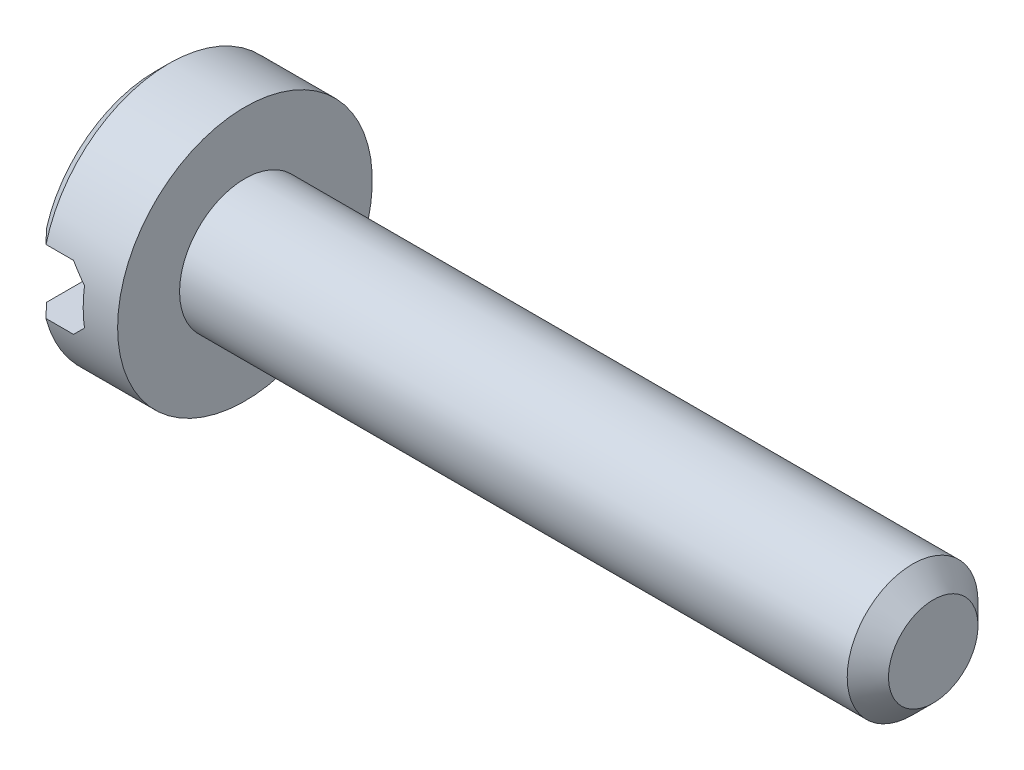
ISO-10303-21;
HEADER;
FILE_DESCRIPTION(('STEP AP214'),'2;1');
FILE_NAME('part.step','',(''),(''),'','','');
FILE_SCHEMA(('AUTOMOTIVE_DESIGN { 1 0 10303 214 1 1 1 1 }'));
ENDSEC;
DATA;
#1=APPLICATION_CONTEXT('core data for automotive mechanical design processes');
#2=APPLICATION_PROTOCOL_DEFINITION('international standard','automotive_design',2000,#1);
#3=PRODUCT_CONTEXT('',#1,'mechanical');
#4=PRODUCT('Part','Part','',(#3));
#5=PRODUCT_RELATED_PRODUCT_CATEGORY('part','',(#4));
#6=PRODUCT_DEFINITION_FORMATION('','',#4);
#7=PRODUCT_DEFINITION_CONTEXT('part definition',#1,'design');
#8=PRODUCT_DEFINITION('design','',#6,#7);
#9=PRODUCT_DEFINITION_SHAPE('','',#8);
#10=(LENGTH_UNIT() NAMED_UNIT(*) SI_UNIT(.MILLI.,.METRE.));
#11=(NAMED_UNIT(*) PLANE_ANGLE_UNIT() SI_UNIT($,.RADIAN.));
#12=(NAMED_UNIT(*) SI_UNIT($,.STERADIAN.) SOLID_ANGLE_UNIT());
#13=UNCERTAINTY_MEASURE_WITH_UNIT(LENGTH_MEASURE(1.E-05),#10,'distance_accuracy_value','');
#14=(GEOMETRIC_REPRESENTATION_CONTEXT(3) GLOBAL_UNCERTAINTY_ASSIGNED_CONTEXT((#13)) GLOBAL_UNIT_ASSIGNED_CONTEXT((#10,
#11,#12)) REPRESENTATION_CONTEXT('',''));
#15=CARTESIAN_POINT('',(0.,0.,0.));
#16=DIRECTION('',(0.,0.,1.));
#17=DIRECTION('',(1.,0.,0.));
#18=AXIS2_PLACEMENT_3D('',#15,#16,#17);
#19=CARTESIAN_POINT('',(1.3,1.85,0.));
#20=DIRECTION('',(-1.,0.,0.));
#21=DIRECTION('',(0.,0.,1.));
#22=AXIS2_PLACEMENT_3D('',#19,#20,#21);
#23=PLANE('',#22);
#24=CARTESIAN_POINT('',(1.3,0.,0.));
#25=DIRECTION('',(-1.,0.,0.));
#26=DIRECTION('',(0.,0.,1.));
#27=AXIS2_PLACEMENT_3D('',#24,#25,#26);
#28=CIRCLE('',#27,1.85);
#29=CARTESIAN_POINT('',(1.3,0.,1.85));
#30=VERTEX_POINT('',#29);
#31=EDGE_CURVE('E111',#30,#30,#28,.T.);
#32=ORIENTED_EDGE('',*,*,#31,.F.);
#33=EDGE_LOOP('',(#32));
#34=FACE_BOUND('',#33,.T.);
#35=CARTESIAN_POINT('',(1.3,0.,0.));
#36=DIRECTION('',(-1.,0.,0.));
#37=DIRECTION('',(0.,0.,1.));
#38=AXIS2_PLACEMENT_3D('',#35,#36,#37);
#39=CIRCLE('',#38,0.95);
#40=CARTESIAN_POINT('',(1.3,0.,0.95));
#41=VERTEX_POINT('',#40);
#42=EDGE_CURVE('E150',#41,#41,#39,.F.);
#43=ORIENTED_EDGE('',*,*,#42,.F.);
#44=EDGE_LOOP('',(#43));
#45=FACE_BOUND('',#44,.T.);
#46=ADVANCED_FACE('F37',(#34,#45),#23,.F.);
#47=CARTESIAN_POINT('',(0.2,0.,0.));
#48=DIRECTION('',(1.,0.,0.));
#49=DIRECTION('',(0.,0.,-1.));
#50=AXIS2_PLACEMENT_3D('',#47,#48,#49);
#51=CONICAL_SURFACE('',#50,1.85,0.785398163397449);
#52=CARTESIAN_POINT('',(0.2,0.,0.));
#53=DIRECTION('',(-1.,0.,0.));
#54=DIRECTION('',(0.,0.,1.));
#55=AXIS2_PLACEMENT_3D('',#52,#53,#54);
#56=CIRCLE('',#55,1.85);
#57=CARTESIAN_POINT('',(0.2,0.465549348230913,1.79046468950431));
#58=VERTEX_POINT('',#57);
#59=CARTESIAN_POINT('',(0.2,0.465549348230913,-1.79046468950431));
#60=VERTEX_POINT('',#59);
#61=EDGE_CURVE('E132',#58,#60,#56,.T.);
#62=ORIENTED_EDGE('',*,*,#61,.T.);
#63=CARTESIAN_POINT('',(2.42344087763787,0.465549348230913,-4.04674985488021));
#64=CARTESIAN_POINT('',(2.31422073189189,0.465549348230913,-3.9368070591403));
#65=CARTESIAN_POINT('',(2.20502763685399,0.465549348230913,-3.82683737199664));
#66=CARTESIAN_POINT('',(1.98669704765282,0.465549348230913,-3.60680197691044));
#67=CARTESIAN_POINT('',(1.87755956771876,0.465549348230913,-3.49673625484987));
#68=CARTESIAN_POINT('',(1.65894933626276,0.465549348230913,-3.27607034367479));
#69=CARTESIAN_POINT('',(1.54947697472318,0.465549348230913,-3.16546976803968));
#70=CARTESIAN_POINT('',(1.33068893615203,0.465549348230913,-2.94415427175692));
#71=CARTESIAN_POINT('',(1.22137323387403,0.465549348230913,-2.83343937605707));
#72=CARTESIAN_POINT('',(0.94158553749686,0.465549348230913,-2.54959909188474));
#73=CARTESIAN_POINT('',(0.771245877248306,0.465549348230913,-2.37634297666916));
#74=CARTESIAN_POINT('',(0.516315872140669,0.465549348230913,-2.11577452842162));
#75=CARTESIAN_POINT('',(0.431406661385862,0.465549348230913,-2.02877427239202));
#76=CARTESIAN_POINT('',(0.261908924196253,0.465549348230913,-1.85447495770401));
#77=CARTESIAN_POINT('',(0.177320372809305,0.465549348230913,-1.76717592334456));
#78=CARTESIAN_POINT('',(0.00893926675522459,0.465549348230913,-1.59244630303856));
#79=CARTESIAN_POINT('',(-0.0748550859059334,0.465549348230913,-1.50501745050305));
#80=CARTESIAN_POINT('',(-0.241707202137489,0.465549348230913,-1.32940591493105));
#81=CARTESIAN_POINT('',(-0.324764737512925,0.465549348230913,-1.24122301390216));
#82=CARTESIAN_POINT('',(-0.448249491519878,0.465549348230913,-1.10803308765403));
#83=CARTESIAN_POINT('',(-0.4892012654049,0.465549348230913,-1.06351303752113));
#84=CARTESIAN_POINT('',(-0.570603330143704,0.465549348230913,-0.974017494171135));
#85=CARTESIAN_POINT('',(-0.61105363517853,0.465549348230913,-0.929042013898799));
#86=CARTESIAN_POINT('',(-0.691196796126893,0.465549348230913,-0.838458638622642));
#87=CARTESIAN_POINT('',(-0.730890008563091,0.465549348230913,-0.792851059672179));
#88=CARTESIAN_POINT('',(-0.809128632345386,0.465549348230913,-0.700664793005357));
#89=CARTESIAN_POINT('',(-0.847674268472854,0.465549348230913,-0.654086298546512));
#90=CARTESIAN_POINT('',(-0.899367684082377,0.465549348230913,-0.588920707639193));
#91=CARTESIAN_POINT('',(-0.913355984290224,0.465549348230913,-0.571002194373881));
#92=CARTESIAN_POINT('',(-0.940978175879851,0.465549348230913,-0.53489334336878));
#93=CARTESIAN_POINT('',(-0.954612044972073,0.465549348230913,-0.516702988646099));
#94=CARTESIAN_POINT('',(-0.994922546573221,0.465549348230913,-0.461548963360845));
#95=CARTESIAN_POINT('',(-1.02093788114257,0.465549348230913,-0.424089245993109));
#96=CARTESIAN_POINT('',(-1.06919063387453,0.465549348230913,-0.348468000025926));
#97=CARTESIAN_POINT('',(-1.09152270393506,0.465549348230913,-0.310367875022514));
#98=CARTESIAN_POINT('',(-1.13109948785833,0.465549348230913,-0.231663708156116));
#99=CARTESIAN_POINT('',(-1.1483700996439,0.465549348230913,-0.191073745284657));
#100=CARTESIAN_POINT('',(-1.16937161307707,0.465549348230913,-0.122137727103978));
#101=CARTESIAN_POINT('',(-1.17573754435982,0.465549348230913,-0.0946292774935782));
#102=CARTESIAN_POINT('',(-1.18362415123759,0.465549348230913,-0.0389959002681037));
#103=CARTESIAN_POINT('',(-1.1851644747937,0.465549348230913,-0.0108739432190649));
#104=CARTESIAN_POINT('',(-1.18310496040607,0.465549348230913,0.0451823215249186));
#105=CARTESIAN_POINT('',(-1.17950248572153,0.465549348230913,0.0731165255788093));
#106=CARTESIAN_POINT('',(-1.16789735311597,0.465549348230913,0.128135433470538));
#107=CARTESIAN_POINT('',(-1.15987428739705,0.465549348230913,0.155215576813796));
#108=CARTESIAN_POINT('',(-1.13863829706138,0.465549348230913,0.213647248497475));
#109=CARTESIAN_POINT('',(-1.12469509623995,0.465549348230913,0.244723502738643));
#110=CARTESIAN_POINT('',(-1.09383840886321,0.465549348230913,0.305390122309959));
#111=CARTESIAN_POINT('',(-1.07691840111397,0.465549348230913,0.334977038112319));
#112=CARTESIAN_POINT('',(-1.04106417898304,0.465549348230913,0.393185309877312));
#113=CARTESIAN_POINT('',(-1.02211606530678,0.465549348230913,0.421797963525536));
#114=CARTESIAN_POINT('',(-0.982981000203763,0.465549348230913,0.478106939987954));
#115=CARTESIAN_POINT('',(-0.962795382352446,0.465549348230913,0.505804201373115));
#116=CARTESIAN_POINT('',(-0.919274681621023,0.465549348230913,0.563580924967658));
#117=CARTESIAN_POINT('',(-0.895838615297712,0.465549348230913,0.593583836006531));
#118=CARTESIAN_POINT('',(-0.848230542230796,0.465549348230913,0.65300190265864));
#119=CARTESIAN_POINT('',(-0.82405844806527,0.465549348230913,0.682416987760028));
#120=CARTESIAN_POINT('',(-0.750747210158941,0.465549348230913,0.770035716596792));
#121=CARTESIAN_POINT('',(-0.700832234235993,0.465549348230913,0.827588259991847));
#122=CARTESIAN_POINT('',(-0.599780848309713,0.465549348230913,0.941762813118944));
#123=CARTESIAN_POINT('',(-0.548642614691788,0.465549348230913,0.998383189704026));
#124=CARTESIAN_POINT('',(-0.445660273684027,0.465549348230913,1.11095186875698));
#125=CARTESIAN_POINT('',(-0.393816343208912,0.465549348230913,1.16690033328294));
#126=CARTESIAN_POINT('',(-0.289869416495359,0.465549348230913,1.27812634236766));
#127=CARTESIAN_POINT('',(-0.237768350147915,0.465549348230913,1.33340569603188));
#128=CARTESIAN_POINT('',(-0.133235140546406,0.465549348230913,1.44365673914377));
#129=CARTESIAN_POINT('',(-0.0808029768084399,0.465549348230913,1.49862840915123));
#130=CARTESIAN_POINT('',(0.0767523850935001,0.465549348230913,1.66311055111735));
#131=CARTESIAN_POINT('',(0.182225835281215,0.465549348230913,1.77228519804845));
#132=CARTESIAN_POINT('',(0.46430719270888,0.465549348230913,2.06287985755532));
#133=CARTESIAN_POINT('',(0.641375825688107,0.465549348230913,2.24385154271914));
#134=CARTESIAN_POINT('',(0.996250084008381,0.465549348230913,2.60519009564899));
#135=CARTESIAN_POINT('',(1.17405593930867,0.465549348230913,2.7855567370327));
#136=CARTESIAN_POINT('',(1.53035733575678,0.465549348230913,3.14622495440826));
#137=CARTESIAN_POINT('',(1.70885353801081,0.465549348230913,3.32652587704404));
#138=CARTESIAN_POINT('',(2.06602855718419,0.465549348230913,3.68681939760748));
#139=CARTESIAN_POINT('',(2.24470728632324,0.465549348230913,3.86681208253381));
#140=CARTESIAN_POINT('',(2.42344087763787,0.465549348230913,4.04674985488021));
#141=B_SPLINE_CURVE_WITH_KNOTS('',3,(#63,#64,#65,#66,#67,#68,#69,#70,#71,#72,#73,#74,#75,#76,
#77,#78,#79,#80,#81,#82,#83,#84,#85,#86,#87,#88,#89,#90,#91,#92,#93,#94,#95,#96,#97,#98,#99,
#100,#101,#102,#103,#104,#105,#106,#107,#108,#109,#110,#111,#112,#113,#114,#115,#116,#117,#118,
#119,#120,#121,#122,#123,#124,#125,#126,#127,#128,#129,#130,#131,#132,#133,#134,#135,#136,#137,
#138,#139,#140),.UNSPECIFIED.,.F.,.F.,(4,2,2,2,2,2,2,2,2,2,2,2,2,2,2,2,2,2,2,2,2,2,2,2,2,2,2,2,
2,2,2,2,2,2,2,2,2,2,4),(0.,0.46491734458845,0.929921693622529,1.39677290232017,1.86353771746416,
2.59243863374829,2.95714021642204,3.32181281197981,3.68511212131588,4.04852027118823,
4.22998896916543,4.41145252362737,4.59282840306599,4.77416851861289,4.84236041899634,
4.91055659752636,5.04728388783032,5.17961007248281,5.31124686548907,5.39561130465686,
5.47963179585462,5.56369538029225,5.64815033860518,5.75007643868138,5.85222867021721,
5.95513223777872,6.05792679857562,6.17212384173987,6.28633450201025,6.51484917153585,
6.74372884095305,6.97255215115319,7.20043854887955,7.42833918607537,7.88374058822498,
8.64329990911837,9.40311729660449,10.1642502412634,10.9251118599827),.UNSPECIFIED.);
#142=CARTESIAN_POINT('',(0.,0.465549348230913,-1.58296045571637));
#143=VERTEX_POINT('',#142);
#144=EDGE_CURVE('E128',#60,#143,#141,.T.);
#145=ORIENTED_EDGE('',*,*,#144,.T.);
#146=CARTESIAN_POINT('',(0.,0.,0.));
#147=DIRECTION('',(-1.,0.,0.));
#148=DIRECTION('',(0.,0.,1.));
#149=AXIS2_PLACEMENT_3D('',#146,#147,#148);
#150=CIRCLE('',#149,1.65);
#151=CARTESIAN_POINT('',(0.,0.465549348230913,1.58296045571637));
#152=VERTEX_POINT('',#151);
#153=EDGE_CURVE('E123',#152,#143,#150,.T.);
#154=ORIENTED_EDGE('',*,*,#153,.F.);
#155=EDGE_CURVE('E191',#152,#58,#141,.T.);
#156=ORIENTED_EDGE('',*,*,#155,.T.);
#157=EDGE_LOOP('',(#62,#145,#154,#156));
#158=FACE_BOUND('',#157,.T.);
#159=ADVANCED_FACE('F166',(#158),#51,.T.);
#160=CARTESIAN_POINT('',(0.,0.,0.));
#161=DIRECTION('',(1.,0.,0.));
#162=DIRECTION('',(0.,0.,-1.));
#163=AXIS2_PLACEMENT_3D('',#160,#161,#162);
#164=PLANE('',#163);
#165=ORIENTED_EDGE('',*,*,#153,.T.);
#166=DIRECTION('',(0.,0.,1.));
#167=VECTOR('',#166,1.);
#168=CARTESIAN_POINT('',(0.,0.465549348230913,0.));
#169=LINE('',#168,#167);
#170=EDGE_CURVE('E110',#143,#152,#169,.T.);
#171=ORIENTED_EDGE('',*,*,#170,.T.);
#172=EDGE_LOOP('',(#165,#171));
#173=FACE_BOUND('',#172,.T.);
#174=ADVANCED_FACE('F171',(#173),#164,.F.);
#175=CARTESIAN_POINT('',(0.,0.,0.));
#176=DIRECTION('',(-1.,0.,0.));
#177=DIRECTION('',(0.,0.,1.));
#178=AXIS2_PLACEMENT_3D('',#175,#176,#177);
#179=CYLINDRICAL_SURFACE('',#178,1.85);
#180=ORIENTED_EDGE('',*,*,#61,.F.);
#181=DIRECTION('',(-1.,0.,0.));
#182=VECTOR('',#181,1.);
#183=CARTESIAN_POINT('',(0.,0.465549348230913,1.79046468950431));
#184=LINE('',#183,#182);
#185=CARTESIAN_POINT('',(0.6,0.465549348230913,1.79046468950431));
#186=VERTEX_POINT('',#185);
#187=EDGE_CURVE('E198',#58,#186,#184,.F.);
#188=ORIENTED_EDGE('',*,*,#187,.T.);
#189=CARTESIAN_POINT('',(1.06554934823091,0.,0.));
#190=DIRECTION('',(0.707106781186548,0.707106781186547,0.));
#191=DIRECTION('',(-0.707106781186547,0.707106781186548,0.));
#192=AXIS2_PLACEMENT_3D('',#189,#190,#191);
#193=ELLIPSE('',#192,2.61629509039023,1.85);
#194=CARTESIAN_POINT('',(0.8,0.265549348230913,1.83084230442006));
#195=VERTEX_POINT('',#194);
#196=EDGE_CURVE('E149',#186,#195,#193,.T.);
#197=ORIENTED_EDGE('',*,*,#196,.T.);
#198=CARTESIAN_POINT('',(0.8,0.,0.));
#199=DIRECTION('',(1.,0.,0.));
#200=DIRECTION('',(0.,0.,-1.));
#201=AXIS2_PLACEMENT_3D('',#198,#199,#200);
#202=CIRCLE('',#201,1.85);
#203=CARTESIAN_POINT('',(0.8,-0.265549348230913,1.83084230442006));
#204=VERTEX_POINT('',#203);
#205=EDGE_CURVE('E60',#195,#204,#202,.T.);
#206=ORIENTED_EDGE('',*,*,#205,.T.);
#207=CARTESIAN_POINT('',(1.06554934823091,0.,0.));
#208=DIRECTION('',(0.707106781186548,-0.707106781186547,0.));
#209=DIRECTION('',(-0.707106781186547,-0.707106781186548,0.));
#210=AXIS2_PLACEMENT_3D('',#207,#208,#209);
#211=ELLIPSE('',#210,2.61629509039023,1.85);
#212=CARTESIAN_POINT('',(0.6,-0.465549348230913,1.79046468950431));
#213=VERTEX_POINT('',#212);
#214=EDGE_CURVE('E143',#204,#213,#211,.T.);
#215=ORIENTED_EDGE('',*,*,#214,.T.);
#216=DIRECTION('',(-1.,0.,0.));
#217=VECTOR('',#216,1.);
#218=CARTESIAN_POINT('',(0.,-0.465549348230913,1.79046468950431));
#219=LINE('',#218,#217);
#220=CARTESIAN_POINT('',(0.2,-0.465549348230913,1.79046468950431));
#221=VERTEX_POINT('',#220);
#222=EDGE_CURVE('E119',#213,#221,#219,.T.);
#223=ORIENTED_EDGE('',*,*,#222,.T.);
#224=CARTESIAN_POINT('',(0.2,-0.465549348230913,-1.79046468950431));
#225=VERTEX_POINT('',#224);
#226=EDGE_CURVE('E118',#225,#221,#56,.T.);
#227=ORIENTED_EDGE('',*,*,#226,.F.);
#228=DIRECTION('',(-1.,0.,0.));
#229=VECTOR('',#228,1.);
#230=CARTESIAN_POINT('',(0.,-0.465549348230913,-1.79046468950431));
#231=LINE('',#230,#229);
#232=CARTESIAN_POINT('',(0.6,-0.465549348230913,-1.79046468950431));
#233=VERTEX_POINT('',#232);
#234=EDGE_CURVE('E120',#225,#233,#231,.F.);
#235=ORIENTED_EDGE('',*,*,#234,.T.);
#236=CARTESIAN_POINT('',(0.8,-0.265549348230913,-1.83084230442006));
#237=VERTEX_POINT('',#236);
#238=EDGE_CURVE('E139',#233,#237,#211,.T.);
#239=ORIENTED_EDGE('',*,*,#238,.T.);
#240=CARTESIAN_POINT('',(0.8,0.265549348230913,-1.83084230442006));
#241=VERTEX_POINT('',#240);
#242=EDGE_CURVE('E142',#237,#241,#202,.T.);
#243=ORIENTED_EDGE('',*,*,#242,.T.);
#244=CARTESIAN_POINT('',(0.6,0.465549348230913,-1.79046468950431));
#245=VERTEX_POINT('',#244);
#246=EDGE_CURVE('E146',#241,#245,#193,.T.);
#247=ORIENTED_EDGE('',*,*,#246,.T.);
#248=DIRECTION('',(-1.,0.,0.));
#249=VECTOR('',#248,1.);
#250=CARTESIAN_POINT('',(0.,0.465549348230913,-1.79046468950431));
#251=LINE('',#250,#249);
#252=EDGE_CURVE('E124',#245,#60,#251,.T.);
#253=ORIENTED_EDGE('',*,*,#252,.T.);
#254=EDGE_LOOP('',(#180,#188,#197,#206,#215,#223,#227,#235,#239,#243,#247,#253));
#255=FACE_BOUND('',#254,.T.);
#256=ORIENTED_EDGE('',*,*,#31,.T.);
#257=EDGE_LOOP('',(#256));
#258=FACE_BOUND('',#257,.T.);
#259=ADVANCED_FACE('F177',(#255,#258),#179,.T.);
#260=ORIENTED_EDGE('',*,*,#226,.T.);
#261=CARTESIAN_POINT('',(2.42344087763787,-0.465549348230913,4.0467498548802));
#262=CARTESIAN_POINT('',(2.31422073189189,-0.465549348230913,3.9368070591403));
#263=CARTESIAN_POINT('',(2.20502763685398,-0.465549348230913,3.82683737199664));
#264=CARTESIAN_POINT('',(1.98669704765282,-0.465549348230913,3.60680197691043));
#265=CARTESIAN_POINT('',(1.87755956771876,-0.465549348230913,3.49673625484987));
#266=CARTESIAN_POINT('',(1.65894933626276,-0.465549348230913,3.27607034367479));
#267=CARTESIAN_POINT('',(1.54947697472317,-0.465549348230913,3.16546976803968));
#268=CARTESIAN_POINT('',(1.33068893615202,-0.465549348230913,2.94415427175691));
#269=CARTESIAN_POINT('',(1.22137323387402,-0.465549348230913,2.83343937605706));
#270=CARTESIAN_POINT('',(0.941585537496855,-0.465549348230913,2.54959909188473));
#271=CARTESIAN_POINT('',(0.771245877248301,-0.465549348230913,2.37634297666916));
#272=CARTESIAN_POINT('',(0.516315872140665,-0.465549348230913,2.11577452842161));
#273=CARTESIAN_POINT('',(0.431406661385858,-0.465549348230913,2.02877427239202));
#274=CARTESIAN_POINT('',(0.261908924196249,-0.465549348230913,1.85447495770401));
#275=CARTESIAN_POINT('',(0.177320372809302,-0.465549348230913,1.76717592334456));
#276=CARTESIAN_POINT('',(0.00893926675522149,-0.465549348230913,1.59244630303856));
#277=CARTESIAN_POINT('',(-0.0748550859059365,-0.465549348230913,1.50501745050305));
#278=CARTESIAN_POINT('',(-0.241707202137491,-0.465549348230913,1.32940591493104));
#279=CARTESIAN_POINT('',(-0.324764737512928,-0.465549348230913,1.24122301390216));
#280=CARTESIAN_POINT('',(-0.44824949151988,-0.465549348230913,1.10803308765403));
#281=CARTESIAN_POINT('',(-0.489201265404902,-0.465549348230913,1.06351303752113));
#282=CARTESIAN_POINT('',(-0.570603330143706,-0.465549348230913,0.974017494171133));
#283=CARTESIAN_POINT('',(-0.611053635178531,-0.465549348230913,0.929042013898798));
#284=CARTESIAN_POINT('',(-0.691196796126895,-0.465549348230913,0.83845863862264));
#285=CARTESIAN_POINT('',(-0.730890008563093,-0.465549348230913,0.792851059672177));
#286=CARTESIAN_POINT('',(-0.809128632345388,-0.465549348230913,0.700664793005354));
#287=CARTESIAN_POINT('',(-0.847674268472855,-0.465549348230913,0.65408629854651));
#288=CARTESIAN_POINT('',(-0.899367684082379,-0.465549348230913,0.588920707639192));
#289=CARTESIAN_POINT('',(-0.913355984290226,-0.465549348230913,0.571002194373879));
#290=CARTESIAN_POINT('',(-0.940978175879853,-0.465549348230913,0.534893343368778));
#291=CARTESIAN_POINT('',(-0.954612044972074,-0.465549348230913,0.516702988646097));
#292=CARTESIAN_POINT('',(-0.994922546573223,-0.465549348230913,0.461548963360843));
#293=CARTESIAN_POINT('',(-1.02093788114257,-0.465549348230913,0.424089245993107));
#294=CARTESIAN_POINT('',(-1.06919063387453,-0.465549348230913,0.348468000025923));
#295=CARTESIAN_POINT('',(-1.09152270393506,-0.465549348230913,0.310367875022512));
#296=CARTESIAN_POINT('',(-1.13109948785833,-0.465549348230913,0.231663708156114));
#297=CARTESIAN_POINT('',(-1.1483700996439,-0.465549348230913,0.191073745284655));
#298=CARTESIAN_POINT('',(-1.16937161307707,-0.465549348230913,0.122137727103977));
#299=CARTESIAN_POINT('',(-1.17573754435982,-0.465549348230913,0.0946292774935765));
#300=CARTESIAN_POINT('',(-1.18362415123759,-0.465549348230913,0.0389959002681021));
#301=CARTESIAN_POINT('',(-1.1851644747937,-0.465549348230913,0.0108739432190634));
#302=CARTESIAN_POINT('',(-1.18310496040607,-0.465549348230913,-0.0451823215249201));
#303=CARTESIAN_POINT('',(-1.17950248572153,-0.465549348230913,-0.0731165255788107));
#304=CARTESIAN_POINT('',(-1.16789735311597,-0.465549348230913,-0.128135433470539));
#305=CARTESIAN_POINT('',(-1.15987428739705,-0.465549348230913,-0.155215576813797));
#306=CARTESIAN_POINT('',(-1.13863829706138,-0.465549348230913,-0.213647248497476));
#307=CARTESIAN_POINT('',(-1.12469509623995,-0.465549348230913,-0.244723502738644));
#308=CARTESIAN_POINT('',(-1.09383840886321,-0.465549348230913,-0.305390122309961));
#309=CARTESIAN_POINT('',(-1.07691840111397,-0.465549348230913,-0.334977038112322));
#310=CARTESIAN_POINT('',(-1.04106417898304,-0.465549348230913,-0.393185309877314));
#311=CARTESIAN_POINT('',(-1.02211606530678,-0.465549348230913,-0.421797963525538));
#312=CARTESIAN_POINT('',(-0.982981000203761,-0.465549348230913,-0.478106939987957));
#313=CARTESIAN_POINT('',(-0.962795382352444,-0.465549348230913,-0.505804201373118));
#314=CARTESIAN_POINT('',(-0.919274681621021,-0.465549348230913,-0.563580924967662));
#315=CARTESIAN_POINT('',(-0.895838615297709,-0.465549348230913,-0.593583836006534));
#316=CARTESIAN_POINT('',(-0.848230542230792,-0.465549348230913,-0.653001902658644));
#317=CARTESIAN_POINT('',(-0.824058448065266,-0.465549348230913,-0.682416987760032));
#318=CARTESIAN_POINT('',(-0.750747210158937,-0.465549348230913,-0.770035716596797));
#319=CARTESIAN_POINT('',(-0.700832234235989,-0.465549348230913,-0.827588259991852));
#320=CARTESIAN_POINT('',(-0.599780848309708,-0.465549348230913,-0.941762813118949));
#321=CARTESIAN_POINT('',(-0.548642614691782,-0.465549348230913,-0.998383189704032));
#322=CARTESIAN_POINT('',(-0.44566027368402,-0.465549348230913,-1.11095186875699));
#323=CARTESIAN_POINT('',(-0.393816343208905,-0.465549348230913,-1.16690033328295));
#324=CARTESIAN_POINT('',(-0.289869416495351,-0.465549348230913,-1.27812634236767));
#325=CARTESIAN_POINT('',(-0.237768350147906,-0.465549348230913,-1.33340569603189));
#326=CARTESIAN_POINT('',(-0.133235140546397,-0.465549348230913,-1.44365673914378));
#327=CARTESIAN_POINT('',(-0.0808029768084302,-0.465549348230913,-1.49862840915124));
#328=CARTESIAN_POINT('',(0.0767523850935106,-0.465549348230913,-1.66311055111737));
#329=CARTESIAN_POINT('',(0.182225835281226,-0.465549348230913,-1.77228519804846));
#330=CARTESIAN_POINT('',(0.464307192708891,-0.465549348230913,-2.06287985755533));
#331=CARTESIAN_POINT('',(0.641375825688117,-0.465549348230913,-2.24385154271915));
#332=CARTESIAN_POINT('',(0.996250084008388,-0.465549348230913,-2.605190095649));
#333=CARTESIAN_POINT('',(1.17405593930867,-0.465549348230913,-2.7855567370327));
#334=CARTESIAN_POINT('',(1.53035733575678,-0.465549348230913,-3.14622495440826));
#335=CARTESIAN_POINT('',(1.70885353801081,-0.465549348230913,-3.32652587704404));
#336=CARTESIAN_POINT('',(2.06602855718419,-0.465549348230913,-3.68681939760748));
#337=CARTESIAN_POINT('',(2.24470728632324,-0.465549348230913,-3.86681208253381));
#338=CARTESIAN_POINT('',(2.42344087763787,-0.465549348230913,-4.0467498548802));
#339=B_SPLINE_CURVE_WITH_KNOTS('',3,(#261,#262,#263,#264,#265,#266,#267,#268,#269,#270,#271,
#272,#273,#274,#275,#276,#277,#278,#279,#280,#281,#282,#283,#284,#285,#286,#287,#288,#289,#290,
#291,#292,#293,#294,#295,#296,#297,#298,#299,#300,#301,#302,#303,#304,#305,#306,#307,#308,#309,
#310,#311,#312,#313,#314,#315,#316,#317,#318,#319,#320,#321,#322,#323,#324,#325,#326,#327,#328,
#329,#330,#331,#332,#333,#334,#335,#336,#337,#338),.UNSPECIFIED.,.F.,.F.,(4,2,2,2,2,2,2,2,2,2,2,
2,2,2,2,2,2,2,2,2,2,2,2,2,2,2,2,2,2,2,2,2,2,2,2,2,2,2,4),(0.,0.46491734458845,0.929921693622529,
1.39677290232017,1.86353771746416,2.59243863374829,2.95714021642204,3.32181281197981,
3.68511212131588,4.04852027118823,4.22998896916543,4.41145252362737,4.59282840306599,
4.77416851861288,4.84236041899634,4.91055659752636,5.04728388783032,5.1796100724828,
5.31124686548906,5.39561130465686,5.47963179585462,5.56369538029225,5.64815033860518,
5.75007643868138,5.85222867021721,5.95513223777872,6.05792679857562,6.17212384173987,
6.28633450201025,6.51484917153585,6.74372884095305,6.97255215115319,7.20043854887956,
7.42833918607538,7.883740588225,8.64329990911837,9.40311729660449,10.1642502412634,
10.9251118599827),.UNSPECIFIED.);
#340=CARTESIAN_POINT('',(0.,-0.465549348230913,1.58296045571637));
#341=VERTEX_POINT('',#340);
#342=EDGE_CURVE('E105',#221,#341,#339,.T.);
#343=ORIENTED_EDGE('',*,*,#342,.T.);
#344=CARTESIAN_POINT('',(0.,-0.465549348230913,-1.58296045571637));
#345=VERTEX_POINT('',#344);
#346=EDGE_CURVE('E116',#345,#341,#150,.T.);
#347=ORIENTED_EDGE('',*,*,#346,.F.);
#348=EDGE_CURVE('E52',#345,#225,#339,.T.);
#349=ORIENTED_EDGE('',*,*,#348,.T.);
#350=EDGE_LOOP('',(#260,#343,#347,#349));
#351=FACE_BOUND('',#350,.T.);
#352=ADVANCED_FACE('F115',(#351),#51,.T.);
#353=ORIENTED_EDGE('',*,*,#346,.T.);
#354=DIRECTION('',(0.,0.,-1.));
#355=VECTOR('',#354,1.);
#356=CARTESIAN_POINT('',(0.,-0.465549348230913,0.));
#357=LINE('',#356,#355);
#358=EDGE_CURVE('E101',#341,#345,#357,.T.);
#359=ORIENTED_EDGE('',*,*,#358,.T.);
#360=EDGE_LOOP('',(#353,#359));
#361=FACE_BOUND('',#360,.T.);
#362=ADVANCED_FACE('F122',(#361),#164,.F.);
#363=CARTESIAN_POINT('',(0.6,0.465549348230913,-5.));
#364=DIRECTION('',(0.707106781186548,0.707106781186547,0.));
#365=DIRECTION('',(-0.707106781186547,0.707106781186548,0.));
#366=AXIS2_PLACEMENT_3D('',#363,#364,#365);
#367=PLANE('',#366);
#368=DIRECTION('',(0.,0.,1.));
#369=VECTOR('',#368,1.);
#370=CARTESIAN_POINT('',(0.6,0.465549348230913,-5.));
#371=LINE('',#370,#369);
#372=EDGE_CURVE('E312',#245,#186,#371,.T.);
#373=ORIENTED_EDGE('',*,*,#372,.F.);
#374=ORIENTED_EDGE('',*,*,#246,.F.);
#375=DIRECTION('',(0.,0.,1.));
#376=VECTOR('',#375,1.);
#377=CARTESIAN_POINT('',(0.8,0.265549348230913,-5.));
#378=LINE('',#377,#376);
#379=EDGE_CURVE('E313',#241,#195,#378,.T.);
#380=ORIENTED_EDGE('',*,*,#379,.T.);
#381=ORIENTED_EDGE('',*,*,#196,.F.);
#382=EDGE_LOOP('',(#373,#374,#380,#381));
#383=FACE_BOUND('',#382,.T.);
#384=ADVANCED_FACE('F206',(#383),#367,.F.);
#385=CARTESIAN_POINT('',(0.8,0.265549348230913,-5.));
#386=DIRECTION('',(1.,0.,0.));
#387=DIRECTION('',(0.,0.,-1.));
#388=AXIS2_PLACEMENT_3D('',#385,#386,#387);
#389=PLANE('',#388);
#390=ORIENTED_EDGE('',*,*,#379,.F.);
#391=ORIENTED_EDGE('',*,*,#242,.F.);
#392=DIRECTION('',(0.,0.,1.));
#393=VECTOR('',#392,1.);
#394=CARTESIAN_POINT('',(0.8,-0.265549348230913,-5.));
#395=LINE('',#394,#393);
#396=EDGE_CURVE('E315',#237,#204,#395,.T.);
#397=ORIENTED_EDGE('',*,*,#396,.T.);
#398=ORIENTED_EDGE('',*,*,#205,.F.);
#399=EDGE_LOOP('',(#390,#391,#397,#398));
#400=FACE_BOUND('',#399,.T.);
#401=ADVANCED_FACE('F209',(#400),#389,.F.);
#402=CARTESIAN_POINT('',(0.6,-0.465549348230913,-5.));
#403=DIRECTION('',(0.707106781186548,-0.707106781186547,0.));
#404=DIRECTION('',(0.707106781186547,0.707106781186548,0.));
#405=AXIS2_PLACEMENT_3D('',#402,#403,#404);
#406=PLANE('',#405);
#407=DIRECTION('',(0.,0.,1.));
#408=VECTOR('',#407,1.);
#409=CARTESIAN_POINT('',(0.6,-0.465549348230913,-5.));
#410=LINE('',#409,#408);
#411=EDGE_CURVE('E318',#233,#213,#410,.T.);
#412=ORIENTED_EDGE('',*,*,#411,.T.);
#413=ORIENTED_EDGE('',*,*,#214,.F.);
#414=ORIENTED_EDGE('',*,*,#396,.F.);
#415=ORIENTED_EDGE('',*,*,#238,.F.);
#416=EDGE_LOOP('',(#412,#413,#414,#415));
#417=FACE_BOUND('',#416,.T.);
#418=ADVANCED_FACE('F204',(#417),#406,.F.);
#419=CARTESIAN_POINT('',(0.,0.465549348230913,-5.));
#420=DIRECTION('',(0.,1.,0.));
#421=DIRECTION('',(0.,0.,1.));
#422=AXIS2_PLACEMENT_3D('',#419,#420,#421);
#423=PLANE('',#422);
#424=ORIENTED_EDGE('',*,*,#372,.T.);
#425=ORIENTED_EDGE('',*,*,#187,.F.);
#426=ORIENTED_EDGE('',*,*,#155,.F.);
#427=ORIENTED_EDGE('',*,*,#170,.F.);
#428=ORIENTED_EDGE('',*,*,#144,.F.);
#429=ORIENTED_EDGE('',*,*,#252,.F.);
#430=EDGE_LOOP('',(#424,#425,#426,#427,#428,#429));
#431=FACE_BOUND('',#430,.T.);
#432=ADVANCED_FACE('F199',(#431),#423,.F.);
#433=CARTESIAN_POINT('',(0.,-0.465549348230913,-5.));
#434=DIRECTION('',(0.,-1.,0.));
#435=DIRECTION('',(0.,0.,-1.));
#436=AXIS2_PLACEMENT_3D('',#433,#434,#435);
#437=PLANE('',#436);
#438=ORIENTED_EDGE('',*,*,#411,.F.);
#439=ORIENTED_EDGE('',*,*,#234,.F.);
#440=ORIENTED_EDGE('',*,*,#348,.F.);
#441=ORIENTED_EDGE('',*,*,#358,.F.);
#442=ORIENTED_EDGE('',*,*,#342,.F.);
#443=ORIENTED_EDGE('',*,*,#222,.F.);
#444=EDGE_LOOP('',(#438,#439,#440,#441,#442,#443));
#445=FACE_BOUND('',#444,.T.);
#446=ADVANCED_FACE('F104',(#445),#437,.F.);
#447=CARTESIAN_POINT('',(11.3,0.,0.));
#448=DIRECTION('',(-1.,0.,0.));
#449=DIRECTION('',(0.,0.,1.));
#450=AXIS2_PLACEMENT_3D('',#447,#448,#449);
#451=CYLINDRICAL_SURFACE('',#450,0.95);
#452=CARTESIAN_POINT('',(11.,0.,0.));
#453=DIRECTION('',(1.,0.,0.));
#454=DIRECTION('',(0.,0.,-1.));
#455=AXIS2_PLACEMENT_3D('',#452,#453,#454);
#456=CIRCLE('',#455,0.95);
#457=CARTESIAN_POINT('',(11.,0.,-0.95));
#458=VERTEX_POINT('',#457);
#459=EDGE_CURVE('E11',#458,#458,#456,.F.);
#460=ORIENTED_EDGE('',*,*,#459,.T.);
#461=EDGE_LOOP('',(#460));
#462=FACE_BOUND('',#461,.T.);
#463=ORIENTED_EDGE('',*,*,#42,.T.);
#464=EDGE_LOOP('',(#463));
#465=FACE_BOUND('',#464,.T.);
#466=ADVANCED_FACE('F162',(#462,#465),#451,.T.);
#467=CARTESIAN_POINT('',(11.3,0.,0.));
#468=DIRECTION('',(1.,0.,0.));
#469=DIRECTION('',(0.,0.,-1.));
#470=AXIS2_PLACEMENT_3D('',#467,#468,#469);
#471=PLANE('',#470);
#472=CARTESIAN_POINT('',(11.3,0.,0.));
#473=DIRECTION('',(1.,0.,0.));
#474=DIRECTION('',(0.,0.,-1.));
#475=AXIS2_PLACEMENT_3D('',#472,#473,#474);
#476=CIRCLE('',#475,0.65);
#477=CARTESIAN_POINT('',(11.3,0.,-0.65));
#478=VERTEX_POINT('',#477);
#479=EDGE_CURVE('E45',#478,#478,#476,.T.);
#480=ORIENTED_EDGE('',*,*,#479,.T.);
#481=EDGE_LOOP('',(#480));
#482=FACE_BOUND('',#481,.T.);
#483=ADVANCED_FACE('F155',(#482),#471,.T.);
#484=CARTESIAN_POINT('',(11.3,0.,0.));
#485=DIRECTION('',(-1.,0.,0.));
#486=DIRECTION('',(0.,0.,1.));
#487=AXIS2_PLACEMENT_3D('',#484,#485,#486);
#488=CONICAL_SURFACE('',#487,0.65,0.785398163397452);
#489=ORIENTED_EDGE('',*,*,#459,.F.);
#490=EDGE_LOOP('',(#489));
#491=FACE_BOUND('',#490,.T.);
#492=ORIENTED_EDGE('',*,*,#479,.F.);
#493=EDGE_LOOP('',(#492));
#494=FACE_BOUND('',#493,.T.);
#495=ADVANCED_FACE('F39',(#491,#494),#488,.T.);
#496=CLOSED_SHELL('',(#46,#159,#174,#259,#352,#362,#384,#401,#418,#432,#446,#466,#483,#495));
#497=MANIFOLD_SOLID_BREP('B2',#496);
#498=ADVANCED_BREP_SHAPE_REPRESENTATION('',(#18,#497),#14);
#499=SHAPE_DEFINITION_REPRESENTATION(#9,#498);
ENDSEC;
END-ISO-10303-21;
